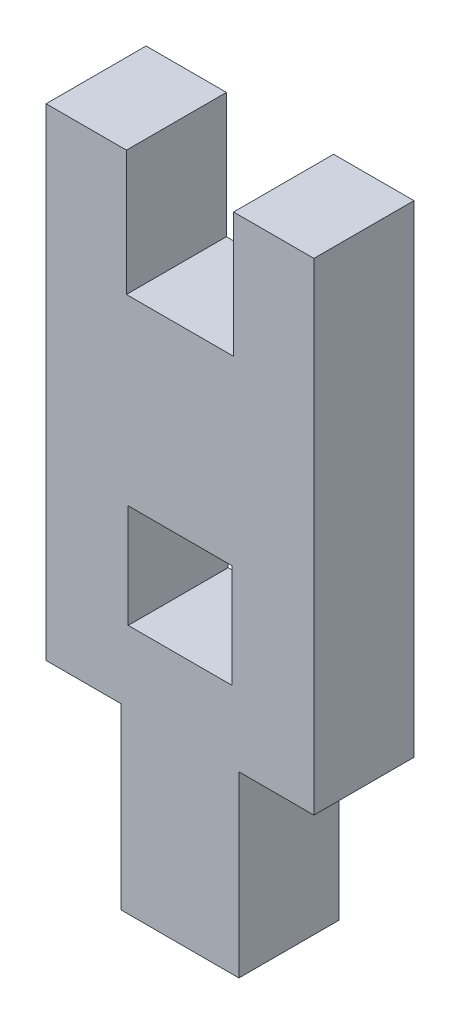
ISO-10303-21;
HEADER;
FILE_DESCRIPTION(('STEP AP214'),'2;1');
FILE_NAME('part.step','',(''),(''),'','','');
FILE_SCHEMA(('AUTOMOTIVE_DESIGN { 1 0 10303 214 1 1 1 1 }'));
ENDSEC;
DATA;
#1=APPLICATION_CONTEXT('core data for automotive mechanical design processes');
#2=APPLICATION_PROTOCOL_DEFINITION('international standard','automotive_design',2000,#1);
#3=PRODUCT_CONTEXT('',#1,'mechanical');
#4=PRODUCT('Part','Part','',(#3));
#5=PRODUCT_RELATED_PRODUCT_CATEGORY('part','',(#4));
#6=PRODUCT_DEFINITION_FORMATION('','',#4);
#7=PRODUCT_DEFINITION_CONTEXT('part definition',#1,'design');
#8=PRODUCT_DEFINITION('design','',#6,#7);
#9=PRODUCT_DEFINITION_SHAPE('','',#8);
#10=(LENGTH_UNIT() NAMED_UNIT(*) SI_UNIT(.MILLI.,.METRE.));
#11=(NAMED_UNIT(*) PLANE_ANGLE_UNIT() SI_UNIT($,.RADIAN.));
#12=(NAMED_UNIT(*) SI_UNIT($,.STERADIAN.) SOLID_ANGLE_UNIT());
#13=UNCERTAINTY_MEASURE_WITH_UNIT(LENGTH_MEASURE(1.E-05),#10,'distance_accuracy_value','');
#14=(GEOMETRIC_REPRESENTATION_CONTEXT(3) GLOBAL_UNCERTAINTY_ASSIGNED_CONTEXT((#13)) GLOBAL_UNIT_ASSIGNED_CONTEXT((#10,
#11,#12)) REPRESENTATION_CONTEXT('',''));
#15=CARTESIAN_POINT('',(0.,0.,0.));
#16=DIRECTION('',(0.,0.,1.));
#17=DIRECTION('',(1.,0.,0.));
#18=AXIS2_PLACEMENT_3D('',#15,#16,#17);
#19=CARTESIAN_POINT('',(0.,0.,2.8));
#20=DIRECTION('',(0.,0.,1.));
#21=DIRECTION('',(1.,0.,0.));
#22=AXIS2_PLACEMENT_3D('',#19,#20,#21);
#23=PLANE('',#22);
#24=DIRECTION('',(0.,-1.,0.));
#25=VECTOR('',#24,1.);
#26=CARTESIAN_POINT('',(0.,0.,2.8));
#27=LINE('',#26,#25);
#28=CARTESIAN_POINT('',(0.,5.,2.8));
#29=VERTEX_POINT('',#28);
#30=CARTESIAN_POINT('',(0.,0.,2.8));
#31=VERTEX_POINT('',#30);
#32=EDGE_CURVE('E205',#29,#31,#27,.T.);
#33=ORIENTED_EDGE('',*,*,#32,.T.);
#34=DIRECTION('',(1.,0.,0.));
#35=VECTOR('',#34,1.);
#36=CARTESIAN_POINT('',(0.,0.,2.8));
#37=LINE('',#36,#35);
#38=CARTESIAN_POINT('',(3.3,0.,2.8));
#39=VERTEX_POINT('',#38);
#40=EDGE_CURVE('E209',#31,#39,#37,.T.);
#41=ORIENTED_EDGE('',*,*,#40,.T.);
#42=DIRECTION('',(0.,1.,0.));
#43=VECTOR('',#42,1.);
#44=CARTESIAN_POINT('',(3.3,0.,2.8));
#45=LINE('',#44,#43);
#46=CARTESIAN_POINT('',(3.3,5.,2.8));
#47=VERTEX_POINT('',#46);
#48=EDGE_CURVE('E213',#39,#47,#45,.T.);
#49=ORIENTED_EDGE('',*,*,#48,.T.);
#50=DIRECTION('',(1.,0.,0.));
#51=VECTOR('',#50,1.);
#52=CARTESIAN_POINT('',(5.4,5.,2.8));
#53=LINE('',#52,#51);
#54=CARTESIAN_POINT('',(5.4,5.,2.8));
#55=VERTEX_POINT('',#54);
#56=EDGE_CURVE('E216',#47,#55,#53,.T.);
#57=ORIENTED_EDGE('',*,*,#56,.T.);
#58=DIRECTION('',(0.,1.,0.));
#59=VECTOR('',#58,1.);
#60=CARTESIAN_POINT('',(5.4,15.5,2.8));
#61=LINE('',#60,#59);
#62=CARTESIAN_POINT('',(5.4,18.5,2.8));
#63=VERTEX_POINT('',#62);
#64=EDGE_CURVE('E219',#55,#63,#61,.T.);
#65=ORIENTED_EDGE('',*,*,#64,.T.);
#66=DIRECTION('',(-1.,0.,0.));
#67=VECTOR('',#66,1.);
#68=CARTESIAN_POINT('',(3.15,18.5,2.8));
#69=LINE('',#68,#67);
#70=CARTESIAN_POINT('',(3.15,18.5,2.8));
#71=VERTEX_POINT('',#70);
#72=EDGE_CURVE('E222',#63,#71,#69,.T.);
#73=ORIENTED_EDGE('',*,*,#72,.T.);
#74=DIRECTION('',(0.,-1.,0.));
#75=VECTOR('',#74,1.);
#76=CARTESIAN_POINT('',(3.15,15.,2.8));
#77=LINE('',#76,#75);
#78=CARTESIAN_POINT('',(3.15,15.,2.8));
#79=VERTEX_POINT('',#78);
#80=EDGE_CURVE('E225',#71,#79,#77,.T.);
#81=ORIENTED_EDGE('',*,*,#80,.T.);
#82=DIRECTION('',(-1.,0.,0.));
#83=VECTOR('',#82,1.);
#84=CARTESIAN_POINT('',(0.149999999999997,15.,2.8));
#85=LINE('',#84,#83);
#86=CARTESIAN_POINT('',(0.149999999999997,15.,2.8));
#87=VERTEX_POINT('',#86);
#88=EDGE_CURVE('E228',#79,#87,#85,.T.);
#89=ORIENTED_EDGE('',*,*,#88,.T.);
#90=DIRECTION('',(0.,1.,0.));
#91=VECTOR('',#90,1.);
#92=CARTESIAN_POINT('',(0.149999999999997,18.5,2.8));
#93=LINE('',#92,#91);
#94=CARTESIAN_POINT('',(0.149999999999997,18.5,2.8));
#95=VERTEX_POINT('',#94);
#96=EDGE_CURVE('E231',#87,#95,#93,.T.);
#97=ORIENTED_EDGE('',*,*,#96,.T.);
#98=DIRECTION('',(-1.,0.,0.));
#99=VECTOR('',#98,1.);
#100=CARTESIAN_POINT('',(-2.1,18.5,2.8));
#101=LINE('',#100,#99);
#102=CARTESIAN_POINT('',(-2.1,18.5,2.8));
#103=VERTEX_POINT('',#102);
#104=EDGE_CURVE('E234',#95,#103,#101,.T.);
#105=ORIENTED_EDGE('',*,*,#104,.T.);
#106=DIRECTION('',(0.,-1.,0.));
#107=VECTOR('',#106,1.);
#108=CARTESIAN_POINT('',(-2.1,12.5,2.8));
#109=LINE('',#108,#107);
#110=CARTESIAN_POINT('',(-2.1,5.,2.8));
#111=VERTEX_POINT('',#110);
#112=EDGE_CURVE('E237',#103,#111,#109,.T.);
#113=ORIENTED_EDGE('',*,*,#112,.T.);
#114=DIRECTION('',(1.,0.,0.));
#115=VECTOR('',#114,1.);
#116=CARTESIAN_POINT('',(0.,5.,2.8));
#117=LINE('',#116,#115);
#118=EDGE_CURVE('E240',#111,#29,#117,.T.);
#119=ORIENTED_EDGE('',*,*,#118,.T.);
#120=EDGE_LOOP('',(#33,#41,#49,#57,#65,#73,#81,#89,#97,#105,#113,#119));
#121=FACE_BOUND('',#120,.T.);
#122=DIRECTION('',(1.,0.,0.));
#123=VECTOR('',#122,1.);
#124=CARTESIAN_POINT('',(0.199999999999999,7.,2.8));
#125=LINE('',#124,#123);
#126=CARTESIAN_POINT('',(0.199999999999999,7.,2.8));
#127=VERTEX_POINT('',#126);
#128=CARTESIAN_POINT('',(3.1,7.,2.8));
#129=VERTEX_POINT('',#128);
#130=EDGE_CURVE('E166',#127,#129,#125,.T.);
#131=ORIENTED_EDGE('',*,*,#130,.F.);
#132=DIRECTION('',(0.,-1.,0.));
#133=VECTOR('',#132,1.);
#134=CARTESIAN_POINT('',(0.199999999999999,7.,2.8));
#135=LINE('',#134,#133);
#136=CARTESIAN_POINT('',(0.199999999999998,9.9,2.8));
#137=VERTEX_POINT('',#136);
#138=EDGE_CURVE('E157',#137,#127,#135,.T.);
#139=ORIENTED_EDGE('',*,*,#138,.F.);
#140=DIRECTION('',(-1.,0.,0.));
#141=VECTOR('',#140,1.);
#142=CARTESIAN_POINT('',(0.199999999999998,9.9,2.8));
#143=LINE('',#142,#141);
#144=CARTESIAN_POINT('',(3.1,9.9,2.8));
#145=VERTEX_POINT('',#144);
#146=EDGE_CURVE('E183',#145,#137,#143,.T.);
#147=ORIENTED_EDGE('',*,*,#146,.F.);
#148=DIRECTION('',(0.,1.,0.));
#149=VECTOR('',#148,1.);
#150=CARTESIAN_POINT('',(3.1,7.,2.8));
#151=LINE('',#150,#149);
#152=EDGE_CURVE('E179',#129,#145,#151,.T.);
#153=ORIENTED_EDGE('',*,*,#152,.F.);
#154=EDGE_LOOP('',(#131,#139,#147,#153));
#155=FACE_BOUND('',#154,.T.);
#156=ADVANCED_FACE('F43',(#121,#155),#23,.T.);
#157=CARTESIAN_POINT('',(0.,0.,0.));
#158=DIRECTION('',(0.,0.,1.));
#159=DIRECTION('',(1.,0.,0.));
#160=AXIS2_PLACEMENT_3D('',#157,#158,#159);
#161=PLANE('',#160);
#162=DIRECTION('',(0.,-1.,0.));
#163=VECTOR('',#162,1.);
#164=CARTESIAN_POINT('',(0.,0.,0.));
#165=LINE('',#164,#163);
#166=CARTESIAN_POINT('',(0.,5.,0.));
#167=VERTEX_POINT('',#166);
#168=CARTESIAN_POINT('',(0.,0.,0.));
#169=VERTEX_POINT('',#168);
#170=EDGE_CURVE('E175',#167,#169,#165,.T.);
#171=ORIENTED_EDGE('',*,*,#170,.F.);
#172=DIRECTION('',(1.,0.,0.));
#173=VECTOR('',#172,1.);
#174=CARTESIAN_POINT('',(0.,5.,0.));
#175=LINE('',#174,#173);
#176=CARTESIAN_POINT('',(-2.1,5.,0.));
#177=VERTEX_POINT('',#176);
#178=EDGE_CURVE('E210',#177,#167,#175,.T.);
#179=ORIENTED_EDGE('',*,*,#178,.F.);
#180=DIRECTION('',(0.,-1.,0.));
#181=VECTOR('',#180,1.);
#182=CARTESIAN_POINT('',(-2.1,5.,0.));
#183=LINE('',#182,#181);
#184=CARTESIAN_POINT('',(-2.1,18.5,0.));
#185=VERTEX_POINT('',#184);
#186=EDGE_CURVE('E276',#185,#177,#183,.T.);
#187=ORIENTED_EDGE('',*,*,#186,.F.);
#188=DIRECTION('',(-1.,0.,0.));
#189=VECTOR('',#188,1.);
#190=CARTESIAN_POINT('',(-2.1,18.5,0.));
#191=LINE('',#190,#189);
#192=CARTESIAN_POINT('',(0.149999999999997,18.5,0.));
#193=VERTEX_POINT('',#192);
#194=EDGE_CURVE('E272',#193,#185,#191,.T.);
#195=ORIENTED_EDGE('',*,*,#194,.F.);
#196=DIRECTION('',(0.,1.,0.));
#197=VECTOR('',#196,1.);
#198=CARTESIAN_POINT('',(0.149999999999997,18.5,0.));
#199=LINE('',#198,#197);
#200=CARTESIAN_POINT('',(0.149999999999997,15.,0.));
#201=VERTEX_POINT('',#200);
#202=EDGE_CURVE('E269',#201,#193,#199,.T.);
#203=ORIENTED_EDGE('',*,*,#202,.F.);
#204=DIRECTION('',(-1.,0.,0.));
#205=VECTOR('',#204,1.);
#206=CARTESIAN_POINT('',(0.149999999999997,15.,0.));
#207=LINE('',#206,#205);
#208=CARTESIAN_POINT('',(3.15,15.,0.));
#209=VERTEX_POINT('',#208);
#210=EDGE_CURVE('E266',#209,#201,#207,.T.);
#211=ORIENTED_EDGE('',*,*,#210,.F.);
#212=DIRECTION('',(0.,-1.,0.));
#213=VECTOR('',#212,1.);
#214=CARTESIAN_POINT('',(3.15,15.,0.));
#215=LINE('',#214,#213);
#216=CARTESIAN_POINT('',(3.15,18.5,0.));
#217=VERTEX_POINT('',#216);
#218=EDGE_CURVE('E263',#217,#209,#215,.T.);
#219=ORIENTED_EDGE('',*,*,#218,.F.);
#220=DIRECTION('',(-1.,0.,0.));
#221=VECTOR('',#220,1.);
#222=CARTESIAN_POINT('',(3.15,18.5,0.));
#223=LINE('',#222,#221);
#224=CARTESIAN_POINT('',(5.4,18.5,0.));
#225=VERTEX_POINT('',#224);
#226=EDGE_CURVE('E260',#225,#217,#223,.T.);
#227=ORIENTED_EDGE('',*,*,#226,.F.);
#228=DIRECTION('',(0.,1.,0.));
#229=VECTOR('',#228,1.);
#230=CARTESIAN_POINT('',(5.4,18.5,0.));
#231=LINE('',#230,#229);
#232=CARTESIAN_POINT('',(5.4,5.,0.));
#233=VERTEX_POINT('',#232);
#234=EDGE_CURVE('E257',#233,#225,#231,.T.);
#235=ORIENTED_EDGE('',*,*,#234,.F.);
#236=DIRECTION('',(1.,0.,0.));
#237=VECTOR('',#236,1.);
#238=CARTESIAN_POINT('',(5.4,5.,0.));
#239=LINE('',#238,#237);
#240=CARTESIAN_POINT('',(3.3,5.,0.));
#241=VERTEX_POINT('',#240);
#242=EDGE_CURVE('E253',#241,#233,#239,.T.);
#243=ORIENTED_EDGE('',*,*,#242,.F.);
#244=DIRECTION('',(0.,1.,0.));
#245=VECTOR('',#244,1.);
#246=CARTESIAN_POINT('',(3.3,0.,0.));
#247=LINE('',#246,#245);
#248=CARTESIAN_POINT('',(3.3,0.,0.));
#249=VERTEX_POINT('',#248);
#250=EDGE_CURVE('E250',#249,#241,#247,.T.);
#251=ORIENTED_EDGE('',*,*,#250,.F.);
#252=DIRECTION('',(1.,0.,0.));
#253=VECTOR('',#252,1.);
#254=CARTESIAN_POINT('',(0.,0.,0.));
#255=LINE('',#254,#253);
#256=EDGE_CURVE('E247',#169,#249,#255,.T.);
#257=ORIENTED_EDGE('',*,*,#256,.F.);
#258=EDGE_LOOP('',(#171,#179,#187,#195,#203,#211,#219,#227,#235,#243,#251,#257));
#259=FACE_BOUND('',#258,.T.);
#260=DIRECTION('',(0.,-1.,0.));
#261=VECTOR('',#260,1.);
#262=CARTESIAN_POINT('',(0.199999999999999,7.,0.));
#263=LINE('',#262,#261);
#264=CARTESIAN_POINT('',(0.199999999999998,9.9,0.));
#265=VERTEX_POINT('',#264);
#266=CARTESIAN_POINT('',(0.199999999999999,7.,0.));
#267=VERTEX_POINT('',#266);
#268=EDGE_CURVE('E67',#265,#267,#263,.T.);
#269=ORIENTED_EDGE('',*,*,#268,.T.);
#270=DIRECTION('',(1.,0.,0.));
#271=VECTOR('',#270,1.);
#272=CARTESIAN_POINT('',(0.199999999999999,7.,0.));
#273=LINE('',#272,#271);
#274=CARTESIAN_POINT('',(3.1,7.,0.));
#275=VERTEX_POINT('',#274);
#276=EDGE_CURVE('E173',#267,#275,#273,.T.);
#277=ORIENTED_EDGE('',*,*,#276,.T.);
#278=DIRECTION('',(0.,1.,0.));
#279=VECTOR('',#278,1.);
#280=CARTESIAN_POINT('',(3.1,7.,0.));
#281=LINE('',#280,#279);
#282=CARTESIAN_POINT('',(3.1,9.9,0.));
#283=VERTEX_POINT('',#282);
#284=EDGE_CURVE('E192',#275,#283,#281,.T.);
#285=ORIENTED_EDGE('',*,*,#284,.T.);
#286=DIRECTION('',(-1.,0.,0.));
#287=VECTOR('',#286,1.);
#288=CARTESIAN_POINT('',(0.199999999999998,9.9,0.));
#289=LINE('',#288,#287);
#290=EDGE_CURVE('E167',#283,#265,#289,.T.);
#291=ORIENTED_EDGE('',*,*,#290,.T.);
#292=EDGE_LOOP('',(#269,#277,#285,#291));
#293=FACE_BOUND('',#292,.T.);
#294=ADVANCED_FACE('F331',(#259,#293),#161,.F.);
#295=CARTESIAN_POINT('',(0.,0.,2.8));
#296=DIRECTION('',(1.,0.,0.));
#297=DIRECTION('',(0.,1.,0.));
#298=AXIS2_PLACEMENT_3D('',#295,#296,#297);
#299=PLANE('',#298);
#300=ORIENTED_EDGE('',*,*,#170,.T.);
#301=DIRECTION('',(0.,0.,-1.));
#302=VECTOR('',#301,1.);
#303=CARTESIAN_POINT('',(0.,0.,2.8));
#304=LINE('',#303,#302);
#305=EDGE_CURVE('E11',#31,#169,#304,.T.);
#306=ORIENTED_EDGE('',*,*,#305,.F.);
#307=ORIENTED_EDGE('',*,*,#32,.F.);
#308=DIRECTION('',(0.,0.,-1.));
#309=VECTOR('',#308,1.);
#310=CARTESIAN_POINT('',(0.,5.,2.8));
#311=LINE('',#310,#309);
#312=EDGE_CURVE('E243',#29,#167,#311,.T.);
#313=ORIENTED_EDGE('',*,*,#312,.T.);
#314=EDGE_LOOP('',(#300,#306,#307,#313));
#315=FACE_BOUND('',#314,.T.);
#316=ADVANCED_FACE('F45',(#315),#299,.F.);
#317=CARTESIAN_POINT('',(0.,0.,2.8));
#318=DIRECTION('',(0.,1.,0.));
#319=DIRECTION('',(-1.,0.,0.));
#320=AXIS2_PLACEMENT_3D('',#317,#318,#319);
#321=PLANE('',#320);
#322=ORIENTED_EDGE('',*,*,#256,.T.);
#323=DIRECTION('',(0.,0.,-1.));
#324=VECTOR('',#323,1.);
#325=CARTESIAN_POINT('',(3.3,0.,2.8));
#326=LINE('',#325,#324);
#327=EDGE_CURVE('E52',#39,#249,#326,.T.);
#328=ORIENTED_EDGE('',*,*,#327,.F.);
#329=ORIENTED_EDGE('',*,*,#40,.F.);
#330=ORIENTED_EDGE('',*,*,#305,.T.);
#331=EDGE_LOOP('',(#322,#328,#329,#330));
#332=FACE_BOUND('',#331,.T.);
#333=ADVANCED_FACE('F347',(#332),#321,.F.);
#334=CARTESIAN_POINT('',(3.3,0.,2.8));
#335=DIRECTION('',(-1.,0.,0.));
#336=DIRECTION('',(0.,-1.,0.));
#337=AXIS2_PLACEMENT_3D('',#334,#335,#336);
#338=PLANE('',#337);
#339=ORIENTED_EDGE('',*,*,#250,.T.);
#340=DIRECTION('',(0.,0.,-1.));
#341=VECTOR('',#340,1.);
#342=CARTESIAN_POINT('',(3.3,5.,2.8));
#343=LINE('',#342,#341);
#344=EDGE_CURVE('E316',#47,#241,#343,.T.);
#345=ORIENTED_EDGE('',*,*,#344,.F.);
#346=ORIENTED_EDGE('',*,*,#48,.F.);
#347=ORIENTED_EDGE('',*,*,#327,.T.);
#348=EDGE_LOOP('',(#339,#345,#346,#347));
#349=FACE_BOUND('',#348,.T.);
#350=ADVANCED_FACE('F325',(#349),#338,.F.);
#351=CARTESIAN_POINT('',(5.4,5.,2.8));
#352=DIRECTION('',(0.,1.,0.));
#353=DIRECTION('',(-1.,0.,0.));
#354=AXIS2_PLACEMENT_3D('',#351,#352,#353);
#355=PLANE('',#354);
#356=ORIENTED_EDGE('',*,*,#242,.T.);
#357=DIRECTION('',(0.,0.,-1.));
#358=VECTOR('',#357,1.);
#359=CARTESIAN_POINT('',(5.4,5.,2.8));
#360=LINE('',#359,#358);
#361=EDGE_CURVE('E312',#55,#233,#360,.T.);
#362=ORIENTED_EDGE('',*,*,#361,.F.);
#363=ORIENTED_EDGE('',*,*,#56,.F.);
#364=ORIENTED_EDGE('',*,*,#344,.T.);
#365=EDGE_LOOP('',(#356,#362,#363,#364));
#366=FACE_BOUND('',#365,.T.);
#367=ADVANCED_FACE('F336',(#366),#355,.F.);
#368=CARTESIAN_POINT('',(5.4,18.5,2.8));
#369=DIRECTION('',(-1.,0.,0.));
#370=DIRECTION('',(0.,-1.,0.));
#371=AXIS2_PLACEMENT_3D('',#368,#369,#370);
#372=PLANE('',#371);
#373=ORIENTED_EDGE('',*,*,#234,.T.);
#374=DIRECTION('',(0.,0.,-1.));
#375=VECTOR('',#374,1.);
#376=CARTESIAN_POINT('',(5.4,18.5,2.8));
#377=LINE('',#376,#375);
#378=EDGE_CURVE('E308',#63,#225,#377,.T.);
#379=ORIENTED_EDGE('',*,*,#378,.F.);
#380=ORIENTED_EDGE('',*,*,#64,.F.);
#381=ORIENTED_EDGE('',*,*,#361,.T.);
#382=EDGE_LOOP('',(#373,#379,#380,#381));
#383=FACE_BOUND('',#382,.T.);
#384=ADVANCED_FACE('F340',(#383),#372,.F.);
#385=CARTESIAN_POINT('',(3.15,18.5,2.8));
#386=DIRECTION('',(0.,-1.,0.));
#387=DIRECTION('',(0.,0.,-1.));
#388=AXIS2_PLACEMENT_3D('',#385,#386,#387);
#389=PLANE('',#388);
#390=ORIENTED_EDGE('',*,*,#226,.T.);
#391=DIRECTION('',(0.,0.,-1.));
#392=VECTOR('',#391,1.);
#393=CARTESIAN_POINT('',(3.15,18.5,2.8));
#394=LINE('',#393,#392);
#395=EDGE_CURVE('E304',#71,#217,#394,.T.);
#396=ORIENTED_EDGE('',*,*,#395,.F.);
#397=ORIENTED_EDGE('',*,*,#72,.F.);
#398=ORIENTED_EDGE('',*,*,#378,.T.);
#399=EDGE_LOOP('',(#390,#396,#397,#398));
#400=FACE_BOUND('',#399,.T.);
#401=ADVANCED_FACE('F379',(#400),#389,.F.);
#402=CARTESIAN_POINT('',(3.15,15.,2.8));
#403=DIRECTION('',(1.,0.,0.));
#404=DIRECTION('',(0.,0.,-1.));
#405=AXIS2_PLACEMENT_3D('',#402,#403,#404);
#406=PLANE('',#405);
#407=ORIENTED_EDGE('',*,*,#218,.T.);
#408=DIRECTION('',(0.,0.,-1.));
#409=VECTOR('',#408,1.);
#410=CARTESIAN_POINT('',(3.15,15.,2.8));
#411=LINE('',#410,#409);
#412=EDGE_CURVE('E300',#79,#209,#411,.T.);
#413=ORIENTED_EDGE('',*,*,#412,.F.);
#414=ORIENTED_EDGE('',*,*,#80,.F.);
#415=ORIENTED_EDGE('',*,*,#395,.T.);
#416=EDGE_LOOP('',(#407,#413,#414,#415));
#417=FACE_BOUND('',#416,.T.);
#418=ADVANCED_FACE('F377',(#417),#406,.F.);
#419=CARTESIAN_POINT('',(0.149999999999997,15.,2.8));
#420=DIRECTION('',(0.,-1.,0.));
#421=DIRECTION('',(0.,0.,-1.));
#422=AXIS2_PLACEMENT_3D('',#419,#420,#421);
#423=PLANE('',#422);
#424=ORIENTED_EDGE('',*,*,#210,.T.);
#425=DIRECTION('',(0.,0.,-1.));
#426=VECTOR('',#425,1.);
#427=CARTESIAN_POINT('',(0.149999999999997,15.,2.8));
#428=LINE('',#427,#426);
#429=EDGE_CURVE('E296',#87,#201,#428,.T.);
#430=ORIENTED_EDGE('',*,*,#429,.F.);
#431=ORIENTED_EDGE('',*,*,#88,.F.);
#432=ORIENTED_EDGE('',*,*,#412,.T.);
#433=EDGE_LOOP('',(#424,#430,#431,#432));
#434=FACE_BOUND('',#433,.T.);
#435=ADVANCED_FACE('F373',(#434),#423,.F.);
#436=CARTESIAN_POINT('',(0.149999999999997,18.5,2.8));
#437=DIRECTION('',(-1.,0.,0.));
#438=DIRECTION('',(0.,0.,1.));
#439=AXIS2_PLACEMENT_3D('',#436,#437,#438);
#440=PLANE('',#439);
#441=ORIENTED_EDGE('',*,*,#202,.T.);
#442=DIRECTION('',(0.,0.,-1.));
#443=VECTOR('',#442,1.);
#444=CARTESIAN_POINT('',(0.149999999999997,18.5,2.8));
#445=LINE('',#444,#443);
#446=EDGE_CURVE('E292',#95,#193,#445,.T.);
#447=ORIENTED_EDGE('',*,*,#446,.F.);
#448=ORIENTED_EDGE('',*,*,#96,.F.);
#449=ORIENTED_EDGE('',*,*,#429,.T.);
#450=EDGE_LOOP('',(#441,#447,#448,#449));
#451=FACE_BOUND('',#450,.T.);
#452=ADVANCED_FACE('F368',(#451),#440,.F.);
#453=CARTESIAN_POINT('',(-2.1,18.5,2.8));
#454=DIRECTION('',(0.,-1.,0.));
#455=DIRECTION('',(0.,0.,-1.));
#456=AXIS2_PLACEMENT_3D('',#453,#454,#455);
#457=PLANE('',#456);
#458=ORIENTED_EDGE('',*,*,#194,.T.);
#459=DIRECTION('',(0.,0.,-1.));
#460=VECTOR('',#459,1.);
#461=CARTESIAN_POINT('',(-2.1,18.5,2.8));
#462=LINE('',#461,#460);
#463=EDGE_CURVE('E288',#103,#185,#462,.T.);
#464=ORIENTED_EDGE('',*,*,#463,.F.);
#465=ORIENTED_EDGE('',*,*,#104,.F.);
#466=ORIENTED_EDGE('',*,*,#446,.T.);
#467=EDGE_LOOP('',(#458,#464,#465,#466));
#468=FACE_BOUND('',#467,.T.);
#469=ADVANCED_FACE('F362',(#468),#457,.F.);
#470=CARTESIAN_POINT('',(-2.1,5.,2.8));
#471=DIRECTION('',(1.,0.,0.));
#472=DIRECTION('',(0.,1.,0.));
#473=AXIS2_PLACEMENT_3D('',#470,#471,#472);
#474=PLANE('',#473);
#475=ORIENTED_EDGE('',*,*,#186,.T.);
#476=DIRECTION('',(0.,0.,-1.));
#477=VECTOR('',#476,1.);
#478=CARTESIAN_POINT('',(-2.1,5.,2.8));
#479=LINE('',#478,#477);
#480=EDGE_CURVE('E284',#111,#177,#479,.T.);
#481=ORIENTED_EDGE('',*,*,#480,.F.);
#482=ORIENTED_EDGE('',*,*,#112,.F.);
#483=ORIENTED_EDGE('',*,*,#463,.T.);
#484=EDGE_LOOP('',(#475,#481,#482,#483));
#485=FACE_BOUND('',#484,.T.);
#486=ADVANCED_FACE('F358',(#485),#474,.F.);
#487=CARTESIAN_POINT('',(0.,5.,2.8));
#488=DIRECTION('',(0.,1.,0.));
#489=DIRECTION('',(0.,0.,1.));
#490=AXIS2_PLACEMENT_3D('',#487,#488,#489);
#491=PLANE('',#490);
#492=ORIENTED_EDGE('',*,*,#178,.T.);
#493=ORIENTED_EDGE('',*,*,#312,.F.);
#494=ORIENTED_EDGE('',*,*,#118,.F.);
#495=ORIENTED_EDGE('',*,*,#480,.T.);
#496=EDGE_LOOP('',(#492,#493,#494,#495));
#497=FACE_BOUND('',#496,.T.);
#498=ADVANCED_FACE('F353',(#497),#491,.F.);
#499=CARTESIAN_POINT('',(0.199999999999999,7.,2.8));
#500=DIRECTION('',(1.,0.,0.));
#501=DIRECTION('',(0.,1.,0.));
#502=AXIS2_PLACEMENT_3D('',#499,#500,#501);
#503=PLANE('',#502);
#504=ORIENTED_EDGE('',*,*,#268,.F.);
#505=DIRECTION('',(0.,0.,-1.));
#506=VECTOR('',#505,1.);
#507=CARTESIAN_POINT('',(0.199999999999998,9.9,2.8));
#508=LINE('',#507,#506);
#509=EDGE_CURVE('E161',#137,#265,#508,.T.);
#510=ORIENTED_EDGE('',*,*,#509,.F.);
#511=ORIENTED_EDGE('',*,*,#138,.T.);
#512=DIRECTION('',(0.,0.,-1.));
#513=VECTOR('',#512,1.);
#514=CARTESIAN_POINT('',(0.199999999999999,7.,2.8));
#515=LINE('',#514,#513);
#516=EDGE_CURVE('E160',#127,#267,#515,.T.);
#517=ORIENTED_EDGE('',*,*,#516,.T.);
#518=EDGE_LOOP('',(#504,#510,#511,#517));
#519=FACE_BOUND('',#518,.T.);
#520=ADVANCED_FACE('F159',(#519),#503,.T.);
#521=CARTESIAN_POINT('',(0.199999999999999,7.,2.8));
#522=DIRECTION('',(0.,1.,0.));
#523=DIRECTION('',(0.,0.,1.));
#524=AXIS2_PLACEMENT_3D('',#521,#522,#523);
#525=PLANE('',#524);
#526=ORIENTED_EDGE('',*,*,#276,.F.);
#527=ORIENTED_EDGE('',*,*,#516,.F.);
#528=ORIENTED_EDGE('',*,*,#130,.T.);
#529=DIRECTION('',(0.,0.,-1.));
#530=VECTOR('',#529,1.);
#531=CARTESIAN_POINT('',(3.1,7.,2.8));
#532=LINE('',#531,#530);
#533=EDGE_CURVE('E176',#129,#275,#532,.T.);
#534=ORIENTED_EDGE('',*,*,#533,.T.);
#535=EDGE_LOOP('',(#526,#527,#528,#534));
#536=FACE_BOUND('',#535,.T.);
#537=ADVANCED_FACE('F170',(#536),#525,.T.);
#538=CARTESIAN_POINT('',(3.1,7.,2.8));
#539=DIRECTION('',(-1.,0.,0.));
#540=DIRECTION('',(0.,0.,1.));
#541=AXIS2_PLACEMENT_3D('',#538,#539,#540);
#542=PLANE('',#541);
#543=ORIENTED_EDGE('',*,*,#284,.F.);
#544=ORIENTED_EDGE('',*,*,#533,.F.);
#545=ORIENTED_EDGE('',*,*,#152,.T.);
#546=DIRECTION('',(0.,0.,-1.));
#547=VECTOR('',#546,1.);
#548=CARTESIAN_POINT('',(3.1,9.9,2.8));
#549=LINE('',#548,#547);
#550=EDGE_CURVE('E59',#145,#283,#549,.T.);
#551=ORIENTED_EDGE('',*,*,#550,.T.);
#552=EDGE_LOOP('',(#543,#544,#545,#551));
#553=FACE_BOUND('',#552,.T.);
#554=ADVANCED_FACE('F437',(#553),#542,.T.);
#555=CARTESIAN_POINT('',(0.199999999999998,9.9,2.8));
#556=DIRECTION('',(0.,-1.,0.));
#557=DIRECTION('',(0.,0.,-1.));
#558=AXIS2_PLACEMENT_3D('',#555,#556,#557);
#559=PLANE('',#558);
#560=ORIENTED_EDGE('',*,*,#290,.F.);
#561=ORIENTED_EDGE('',*,*,#550,.F.);
#562=ORIENTED_EDGE('',*,*,#146,.T.);
#563=ORIENTED_EDGE('',*,*,#509,.T.);
#564=EDGE_LOOP('',(#560,#561,#562,#563));
#565=FACE_BOUND('',#564,.T.);
#566=ADVANCED_FACE('F443',(#565),#559,.T.);
#567=CLOSED_SHELL('',(#156,#294,#316,#333,#350,#367,#384,#401,#418,#435,#452,#469,#486,#498,
#520,#537,#554,#566));
#568=MANIFOLD_SOLID_BREP('B2',#567);
#569=ADVANCED_BREP_SHAPE_REPRESENTATION('',(#18,#568),#14);
#570=SHAPE_DEFINITION_REPRESENTATION(#9,#569);
ENDSEC;
END-ISO-10303-21;
